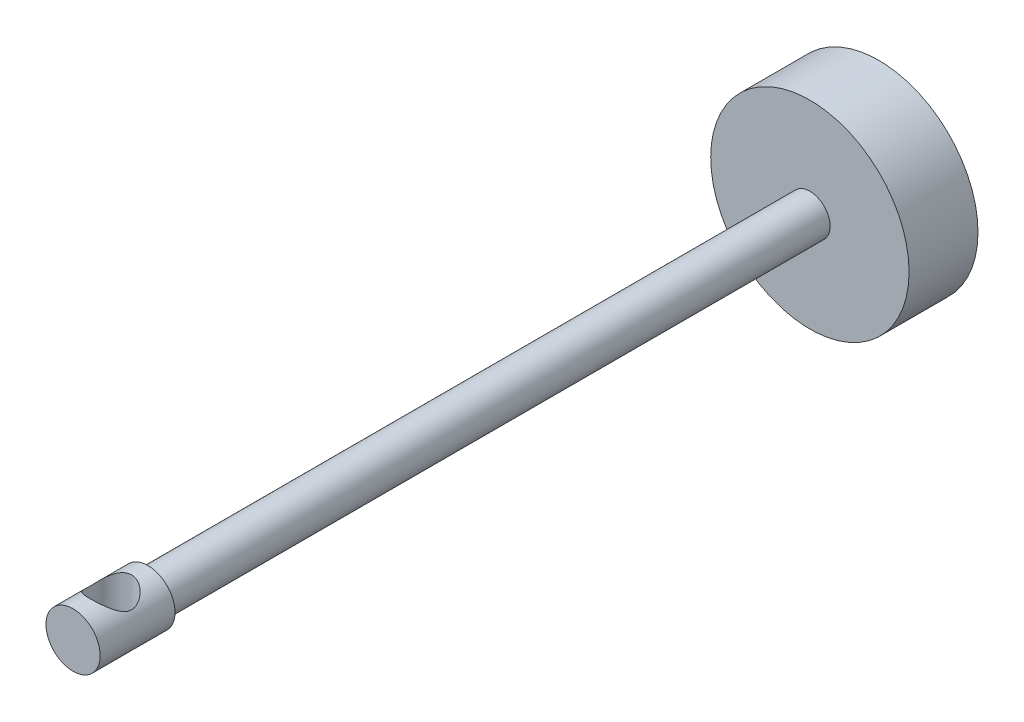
ISO-10303-21;
HEADER;
FILE_DESCRIPTION(('STEP AP214'),'2;1');
FILE_NAME('part.step','',(''),(''),'','','');
FILE_SCHEMA(('AUTOMOTIVE_DESIGN { 1 0 10303 214 1 1 1 1 }'));
ENDSEC;
DATA;
#1=APPLICATION_CONTEXT('core data for automotive mechanical design processes');
#2=APPLICATION_PROTOCOL_DEFINITION('international standard','automotive_design',2000,#1);
#3=PRODUCT_CONTEXT('',#1,'mechanical');
#4=PRODUCT('Part','Part','',(#3));
#5=PRODUCT_RELATED_PRODUCT_CATEGORY('part','',(#4));
#6=PRODUCT_DEFINITION_FORMATION('','',#4);
#7=PRODUCT_DEFINITION_CONTEXT('part definition',#1,'design');
#8=PRODUCT_DEFINITION('design','',#6,#7);
#9=PRODUCT_DEFINITION_SHAPE('','',#8);
#10=(LENGTH_UNIT() NAMED_UNIT(*) SI_UNIT(.MILLI.,.METRE.));
#11=(NAMED_UNIT(*) PLANE_ANGLE_UNIT() SI_UNIT($,.RADIAN.));
#12=(NAMED_UNIT(*) SI_UNIT($,.STERADIAN.) SOLID_ANGLE_UNIT());
#13=UNCERTAINTY_MEASURE_WITH_UNIT(LENGTH_MEASURE(1.E-05),#10,'distance_accuracy_value','');
#14=(GEOMETRIC_REPRESENTATION_CONTEXT(3) GLOBAL_UNCERTAINTY_ASSIGNED_CONTEXT((#13)) GLOBAL_UNIT_ASSIGNED_CONTEXT((#10,
#11,#12)) REPRESENTATION_CONTEXT('',''));
#15=CARTESIAN_POINT('',(0.,0.,0.));
#16=DIRECTION('',(0.,0.,1.));
#17=DIRECTION('',(1.,0.,0.));
#18=AXIS2_PLACEMENT_3D('',#15,#16,#17);
#19=CARTESIAN_POINT('',(0.,0.,93.5482));
#20=DIRECTION('',(0.,0.,-0.999999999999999));
#21=DIRECTION('',(-1.,0.,0.));
#22=AXIS2_PLACEMENT_3D('',#19,#20,#21);
#23=CYLINDRICAL_SURFACE('',#22,2.3495);
#24=CARTESIAN_POINT('',(0.,0.,8.00099999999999));
#25=DIRECTION('',(0.,0.,0.999999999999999));
#26=DIRECTION('',(1.,0.,0.));
#27=AXIS2_PLACEMENT_3D('',#24,#25,#26);
#28=CIRCLE('',#27,2.3495);
#29=CARTESIAN_POINT('',(-2.3495,0.,8.00099999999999));
#30=VERTEX_POINT('',#29);
#31=EDGE_CURVE('E97',#30,#30,#28,.F.);
#32=CARTESIAN_POINT('',(0.,0.,84.8614));
#33=DIRECTION('',(0.,0.,0.999999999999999));
#34=DIRECTION('',(1.,0.,0.));
#35=AXIS2_PLACEMENT_3D('',#32,#33,#34);
#36=CIRCLE('',#35,2.3495);
#37=CARTESIAN_POINT('',(-2.3495,0.,84.8614));
#38=VERTEX_POINT('',#37);
#39=EDGE_CURVE('E10',#38,#38,#36,.T.);
#40=CARTESIAN_POINT('',(-2.3495,0.,8.00099999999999));
#41=CARTESIAN_POINT('',(-2.3495,0.,8.80162916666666));
#42=CARTESIAN_POINT('',(-2.3495,0.,9.60225833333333));
#43=CARTESIAN_POINT('',(-2.3495,0.,11.2035166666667));
#44=CARTESIAN_POINT('',(-2.3495,0.,12.0041458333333));
#45=CARTESIAN_POINT('',(-2.3495,0.,13.6054041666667));
#46=CARTESIAN_POINT('',(-2.3495,0.,14.4060333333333));
#47=CARTESIAN_POINT('',(-2.3495,0.,16.0072916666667));
#48=CARTESIAN_POINT('',(-2.3495,0.,16.8079208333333));
#49=CARTESIAN_POINT('',(-2.3495,0.,18.4091791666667));
#50=CARTESIAN_POINT('',(-2.3495,0.,19.2098083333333));
#51=CARTESIAN_POINT('',(-2.3495,0.,20.8110666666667));
#52=CARTESIAN_POINT('',(-2.3495,0.,21.6116958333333));
#53=CARTESIAN_POINT('',(-2.3495,0.,23.2129541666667));
#54=CARTESIAN_POINT('',(-2.3495,0.,24.0135833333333));
#55=CARTESIAN_POINT('',(-2.3495,0.,25.6148416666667));
#56=CARTESIAN_POINT('',(-2.3495,0.,26.4154708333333));
#57=CARTESIAN_POINT('',(-2.3495,0.,28.0167291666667));
#58=CARTESIAN_POINT('',(-2.3495,0.,28.8173583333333));
#59=CARTESIAN_POINT('',(-2.3495,0.,30.4186166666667));
#60=CARTESIAN_POINT('',(-2.3495,0.,31.2192458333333));
#61=CARTESIAN_POINT('',(-2.3495,0.,32.8205041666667));
#62=CARTESIAN_POINT('',(-2.3495,0.,33.6211333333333));
#63=CARTESIAN_POINT('',(-2.3495,0.,35.2223916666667));
#64=CARTESIAN_POINT('',(-2.3495,0.,36.0230208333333));
#65=CARTESIAN_POINT('',(-2.3495,0.,37.6242791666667));
#66=CARTESIAN_POINT('',(-2.3495,0.,38.4249083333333));
#67=CARTESIAN_POINT('',(-2.3495,0.,40.0261666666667));
#68=CARTESIAN_POINT('',(-2.3495,0.,40.8267958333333));
#69=CARTESIAN_POINT('',(-2.3495,0.,42.4280541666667));
#70=CARTESIAN_POINT('',(-2.3495,0.,43.2286833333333));
#71=CARTESIAN_POINT('',(-2.3495,0.,44.8299416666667));
#72=CARTESIAN_POINT('',(-2.3495,0.,45.6305708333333));
#73=CARTESIAN_POINT('',(-2.3495,0.,47.2318291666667));
#74=CARTESIAN_POINT('',(-2.3495,0.,48.0324583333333));
#75=CARTESIAN_POINT('',(-2.3495,0.,49.6337166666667));
#76=CARTESIAN_POINT('',(-2.3495,0.,50.4343458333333));
#77=CARTESIAN_POINT('',(-2.3495,0.,52.0356041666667));
#78=CARTESIAN_POINT('',(-2.3495,0.,52.8362333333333));
#79=CARTESIAN_POINT('',(-2.3495,0.,54.4374916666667));
#80=CARTESIAN_POINT('',(-2.3495,0.,55.2381208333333));
#81=CARTESIAN_POINT('',(-2.3495,0.,56.8393791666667));
#82=CARTESIAN_POINT('',(-2.3495,0.,57.6400083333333));
#83=CARTESIAN_POINT('',(-2.3495,0.,59.2412666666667));
#84=CARTESIAN_POINT('',(-2.3495,0.,60.0418958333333));
#85=CARTESIAN_POINT('',(-2.3495,0.,61.6431541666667));
#86=CARTESIAN_POINT('',(-2.3495,0.,62.4437833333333));
#87=CARTESIAN_POINT('',(-2.3495,0.,64.0450416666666));
#88=CARTESIAN_POINT('',(-2.3495,0.,64.8456708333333));
#89=CARTESIAN_POINT('',(-2.3495,0.,66.4469291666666));
#90=CARTESIAN_POINT('',(-2.3495,0.,67.2475583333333));
#91=CARTESIAN_POINT('',(-2.3495,0.,68.8488166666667));
#92=CARTESIAN_POINT('',(-2.3495,0.,69.6494458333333));
#93=CARTESIAN_POINT('',(-2.3495,0.,71.2507041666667));
#94=CARTESIAN_POINT('',(-2.3495,0.,72.0513333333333));
#95=CARTESIAN_POINT('',(-2.3495,0.,73.6525916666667));
#96=CARTESIAN_POINT('',(-2.3495,0.,74.4532208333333));
#97=CARTESIAN_POINT('',(-2.3495,0.,76.0544791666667));
#98=CARTESIAN_POINT('',(-2.3495,0.,76.8551083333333));
#99=CARTESIAN_POINT('',(-2.3495,0.,78.4563666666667));
#100=CARTESIAN_POINT('',(-2.3495,0.,79.2569958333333));
#101=CARTESIAN_POINT('',(-2.3495,0.,80.8582541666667));
#102=CARTESIAN_POINT('',(-2.3495,0.,81.6588833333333));
#103=CARTESIAN_POINT('',(-2.3495,0.,83.2601416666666));
#104=CARTESIAN_POINT('',(-2.3495,0.,84.0607708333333));
#105=CARTESIAN_POINT('',(-2.3495,0.,84.8614));
#106=B_SPLINE_CURVE_WITH_KNOTS('',3,(#40,#41,#42,#43,#44,#45,#46,#47,#48,#49,#50,#51,#52,#53,
#54,#55,#56,#57,#58,#59,#60,#61,#62,#63,#64,#65,#66,#67,#68,#69,#70,#71,#72,#73,#74,#75,#76,#77,
#78,#79,#80,#81,#82,#83,#84,#85,#86,#87,#88,#89,#90,#91,#92,#93,#94,#95,#96,#97,#98,#99,#100,
#101,#102,#103,#104,#105),.UNSPECIFIED.,.F.,.F.,(4,2,2,2,2,2,2,2,2,2,2,2,2,2,2,2,2,2,2,2,2,2,2,
2,2,2,2,2,2,2,2,2,4),(0.,2.40188750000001,4.803775,7.2056625,9.60755000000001,12.0094375,
14.411325,16.8132125,19.2151,21.6169875,24.018875,26.4207625,28.82265,31.2245375,33.626425,
36.0283125,38.4302,40.8320875,43.233975,45.6358625,48.03775,50.4396375,52.841525,55.2434125,
57.6453,60.0471875,62.449075,64.8509625,67.25285,69.6547375,72.056625,74.4585125,76.8604),.UNSPECIFIED.);
#107=EDGE_CURVE('BSEAM30',#30,#38,#106,.T.);
#108=ORIENTED_EDGE('',*,*,#31,.F.);
#109=ORIENTED_EDGE('',*,*,#39,.F.);
#110=ORIENTED_EDGE('',*,*,#107,.T.);
#111=ORIENTED_EDGE('',*,*,#107,.F.);
#112=EDGE_LOOP('',(#108,#110,#109,#111));
#113=FACE_BOUND('',#112,.T.);
#114=ADVANCED_FACE('F30',(#113),#23,.T.);
#115=CARTESIAN_POINT('',(0.,0.,8.00099999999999));
#116=DIRECTION('',(0.,0.,0.999999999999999));
#117=DIRECTION('',(1.,0.,0.));
#118=AXIS2_PLACEMENT_3D('',#115,#116,#117);
#119=PLANE('',#118);
#120=CARTESIAN_POINT('',(0.,0.,8.00099999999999));
#121=DIRECTION('',(0.,0.,0.999999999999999));
#122=DIRECTION('',(1.,0.,0.));
#123=AXIS2_PLACEMENT_3D('',#120,#121,#122);
#124=CIRCLE('',#123,11.51636);
#125=CARTESIAN_POINT('',(-11.51636,0.,8.00099999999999));
#126=VERTEX_POINT('',#125);
#127=EDGE_CURVE('E42',#126,#126,#124,.T.);
#128=ORIENTED_EDGE('',*,*,#127,.T.);
#129=EDGE_LOOP('',(#128));
#130=FACE_BOUND('',#129,.T.);
#131=ORIENTED_EDGE('',*,*,#31,.T.);
#132=EDGE_LOOP('',(#131));
#133=FACE_BOUND('',#132,.T.);
#134=ADVANCED_FACE('F77',(#130,#133),#119,.T.);
#135=CARTESIAN_POINT('',(0.,0.,8.00099999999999));
#136=DIRECTION('',(0.,0.,-0.999999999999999));
#137=DIRECTION('',(-1.,0.,0.));
#138=AXIS2_PLACEMENT_3D('',#135,#136,#137);
#139=CYLINDRICAL_SURFACE('',#138,11.51636);
#140=CARTESIAN_POINT('',(0.,0.,0.));
#141=DIRECTION('',(0.,0.,0.999999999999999));
#142=DIRECTION('',(1.,0.,0.));
#143=AXIS2_PLACEMENT_3D('',#140,#141,#142);
#144=CIRCLE('',#143,11.51636);
#145=CARTESIAN_POINT('',(-11.51636,0.,0.));
#146=VERTEX_POINT('',#145);
#147=EDGE_CURVE('E47',#146,#146,#144,.T.);
#148=CARTESIAN_POINT('',(-11.51636,0.,8.00099999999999));
#149=CARTESIAN_POINT('',(-11.51636,0.,7.91765624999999));
#150=CARTESIAN_POINT('',(-11.51636,0.,7.8343125));
#151=CARTESIAN_POINT('',(-11.51636,0.,7.667625));
#152=CARTESIAN_POINT('',(-11.51636,0.,7.58428125));
#153=CARTESIAN_POINT('',(-11.51636,0.,7.41759375));
#154=CARTESIAN_POINT('',(-11.51636,0.,7.33425));
#155=CARTESIAN_POINT('',(-11.51636,0.,7.1675625));
#156=CARTESIAN_POINT('',(-11.51636,0.,7.08421875));
#157=CARTESIAN_POINT('',(-11.51636,0.,6.91753125));
#158=CARTESIAN_POINT('',(-11.51636,0.,6.8341875));
#159=CARTESIAN_POINT('',(-11.51636,0.,6.6675));
#160=CARTESIAN_POINT('',(-11.51636,0.,6.58415625));
#161=CARTESIAN_POINT('',(-11.51636,0.,6.41746875));
#162=CARTESIAN_POINT('',(-11.51636,0.,6.334125));
#163=CARTESIAN_POINT('',(-11.51636,0.,6.1674375));
#164=CARTESIAN_POINT('',(-11.51636,0.,6.08409375));
#165=CARTESIAN_POINT('',(-11.51636,0.,5.91740625));
#166=CARTESIAN_POINT('',(-11.51636,0.,5.8340625));
#167=CARTESIAN_POINT('',(-11.51636,0.,5.667375));
#168=CARTESIAN_POINT('',(-11.51636,0.,5.58403125));
#169=CARTESIAN_POINT('',(-11.51636,0.,5.41734375));
#170=CARTESIAN_POINT('',(-11.51636,0.,5.334));
#171=CARTESIAN_POINT('',(-11.51636,0.,5.1673125));
#172=CARTESIAN_POINT('',(-11.51636,0.,5.08396875));
#173=CARTESIAN_POINT('',(-11.51636,0.,4.91728125));
#174=CARTESIAN_POINT('',(-11.51636,0.,4.8339375));
#175=CARTESIAN_POINT('',(-11.51636,0.,4.66725));
#176=CARTESIAN_POINT('',(-11.51636,0.,4.58390625));
#177=CARTESIAN_POINT('',(-11.51636,0.,4.41721875));
#178=CARTESIAN_POINT('',(-11.51636,0.,4.333875));
#179=CARTESIAN_POINT('',(-11.51636,0.,4.1671875));
#180=CARTESIAN_POINT('',(-11.51636,0.,4.08384375));
#181=CARTESIAN_POINT('',(-11.51636,0.,3.91715625));
#182=CARTESIAN_POINT('',(-11.51636,0.,3.8338125));
#183=CARTESIAN_POINT('',(-11.51636,0.,3.667125));
#184=CARTESIAN_POINT('',(-11.51636,0.,3.58378125));
#185=CARTESIAN_POINT('',(-11.51636,0.,3.41709375));
#186=CARTESIAN_POINT('',(-11.51636,0.,3.33375));
#187=CARTESIAN_POINT('',(-11.51636,0.,3.1670625));
#188=CARTESIAN_POINT('',(-11.51636,0.,3.08371875));
#189=CARTESIAN_POINT('',(-11.51636,0.,2.91703125));
#190=CARTESIAN_POINT('',(-11.51636,0.,2.8336875));
#191=CARTESIAN_POINT('',(-11.51636,0.,2.667));
#192=CARTESIAN_POINT('',(-11.51636,0.,2.58365625));
#193=CARTESIAN_POINT('',(-11.51636,0.,2.41696875));
#194=CARTESIAN_POINT('',(-11.51636,0.,2.333625));
#195=CARTESIAN_POINT('',(-11.51636,0.,2.1669375));
#196=CARTESIAN_POINT('',(-11.51636,0.,2.08359375));
#197=CARTESIAN_POINT('',(-11.51636,0.,1.91690625));
#198=CARTESIAN_POINT('',(-11.51636,0.,1.8335625));
#199=CARTESIAN_POINT('',(-11.51636,0.,1.666875));
#200=CARTESIAN_POINT('',(-11.51636,0.,1.58353125));
#201=CARTESIAN_POINT('',(-11.51636,0.,1.41684375));
#202=CARTESIAN_POINT('',(-11.51636,0.,1.3335));
#203=CARTESIAN_POINT('',(-11.51636,0.,1.1668125));
#204=CARTESIAN_POINT('',(-11.51636,0.,1.08346875));
#205=CARTESIAN_POINT('',(-11.51636,0.,0.916781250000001));
#206=CARTESIAN_POINT('',(-11.51636,0.,0.833437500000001));
#207=CARTESIAN_POINT('',(-11.51636,0.,0.666750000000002));
#208=CARTESIAN_POINT('',(-11.51636,0.,0.583406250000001));
#209=CARTESIAN_POINT('',(-11.51636,0.,0.416718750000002));
#210=CARTESIAN_POINT('',(-11.51636,0.,0.333375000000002));
#211=CARTESIAN_POINT('',(-11.51636,0.,0.166687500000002));
#212=CARTESIAN_POINT('',(-11.51636,0.,0.0833437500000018));
#213=CARTESIAN_POINT('',(-11.51636,0.,0.));
#214=B_SPLINE_CURVE_WITH_KNOTS('',3,(#148,#149,#150,#151,#152,#153,#154,#155,#156,#157,#158,
#159,#160,#161,#162,#163,#164,#165,#166,#167,#168,#169,#170,#171,#172,#173,#174,#175,#176,#177,
#178,#179,#180,#181,#182,#183,#184,#185,#186,#187,#188,#189,#190,#191,#192,#193,#194,#195,#196,
#197,#198,#199,#200,#201,#202,#203,#204,#205,#206,#207,#208,#209,#210,#211,#212,#213),
.UNSPECIFIED.,.F.,.F.,(4,2,2,2,2,2,2,2,2,2,2,2,2,2,2,2,2,2,2,2,2,2,2,2,2,2,2,2,2,2,2,2,4),(0.,
0.250031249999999,0.500062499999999,0.750093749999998,1.000125,1.25015625,1.5001875,1.75021875,
2.00025,2.25028125,2.5003125,2.75034375,3.000375,3.25040625,3.5004375,3.75046875,4.0005,
4.25053125,4.50056249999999,4.75059374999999,5.00062499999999,5.25065625,5.50068749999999,
5.75071874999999,6.00074999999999,6.25078124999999,6.50081249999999,6.75084374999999,
7.00087499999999,7.25090624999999,7.50093749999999,7.75096874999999,8.00099999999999),.UNSPECIFIED.);
#215=EDGE_CURVE('BSEAM32',#126,#146,#214,.T.);
#216=ORIENTED_EDGE('',*,*,#127,.F.);
#217=ORIENTED_EDGE('',*,*,#147,.T.);
#218=ORIENTED_EDGE('',*,*,#215,.T.);
#219=ORIENTED_EDGE('',*,*,#215,.F.);
#220=EDGE_LOOP('',(#216,#218,#217,#219));
#221=FACE_BOUND('',#220,.T.);
#222=ADVANCED_FACE('F32',(#221),#139,.T.);
#223=CARTESIAN_POINT('',(0.,0.,0.));
#224=DIRECTION('',(0.,0.,0.999999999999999));
#225=DIRECTION('',(1.,0.,0.));
#226=AXIS2_PLACEMENT_3D('',#223,#224,#225);
#227=PLANE('',#226);
#228=ORIENTED_EDGE('',*,*,#147,.F.);
#229=EDGE_LOOP('',(#228));
#230=FACE_BOUND('',#229,.T.);
#231=ADVANCED_FACE('F66',(#230),#227,.F.);
#232=CARTESIAN_POINT('',(0.,0.,84.8614));
#233=DIRECTION('',(0.,0.,0.999999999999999));
#234=DIRECTION('',(1.,0.,0.));
#235=AXIS2_PLACEMENT_3D('',#232,#233,#234);
#236=PLANE('',#235);
#237=CARTESIAN_POINT('',(0.,0.,84.8614));
#238=DIRECTION('',(0.,0.,0.999999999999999));
#239=DIRECTION('',(1.,0.,0.));
#240=AXIS2_PLACEMENT_3D('',#237,#238,#239);
#241=CIRCLE('',#240,3.1496);
#242=CARTESIAN_POINT('',(3.14960000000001,0.,84.8614));
#243=VERTEX_POINT('',#242);
#244=EDGE_CURVE('E94',#243,#243,#241,.T.);
#245=ORIENTED_EDGE('',*,*,#244,.F.);
#246=EDGE_LOOP('',(#245));
#247=FACE_BOUND('',#246,.T.);
#248=ORIENTED_EDGE('',*,*,#39,.T.);
#249=EDGE_LOOP('',(#248));
#250=FACE_BOUND('',#249,.T.);
#251=ADVANCED_FACE('F63',(#247,#250),#236,.F.);
#252=CARTESIAN_POINT('',(0.,0.,84.8614));
#253=DIRECTION('',(0.,0.,0.999999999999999));
#254=DIRECTION('',(1.,0.,0.));
#255=AXIS2_PLACEMENT_3D('',#252,#253,#254);
#256=CYLINDRICAL_SURFACE('',#255,3.1496);
#257=CARTESIAN_POINT('',(0.,-3.14959999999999,91.5542999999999));
#258=CARTESIAN_POINT('',(-0.116753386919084,-3.14959081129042,91.554290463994));
#259=CARTESIAN_POINT('',(-0.233649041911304,-3.14304210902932,91.5457147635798));
#260=CARTESIAN_POINT('',(-0.463709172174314,-3.11743809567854,91.5119643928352));
#261=CARTESIAN_POINT('',(-0.576865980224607,-3.09835857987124,91.4867575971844));
#262=CARTESIAN_POINT('',(-0.795546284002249,-3.04951955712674,91.421486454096));
#263=CARTESIAN_POINT('',(-0.901110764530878,-3.01982353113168,91.381510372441));
#264=CARTESIAN_POINT('',(-1.10331111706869,-2.95196125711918,91.288605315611));
#265=CARTESIAN_POINT('',(-1.19994820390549,-2.91379616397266,91.235678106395));
#266=CARTESIAN_POINT('',(-1.39183412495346,-2.82751662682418,91.1131793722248));
#267=CARTESIAN_POINT('',(-1.48611192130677,-2.77880608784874,91.0425155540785));
#268=CARTESIAN_POINT('',(-1.66224686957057,-2.67717756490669,90.8895149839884));
#269=CARTESIAN_POINT('',(-1.74408527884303,-2.62425341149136,90.8071609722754));
#270=CARTESIAN_POINT('',(-1.91071251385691,-2.50631564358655,90.6135250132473));
#271=CARTESIAN_POINT('',(-1.99252333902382,-2.44109349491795,90.4997979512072));
#272=CARTESIAN_POINT('',(-2.13623724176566,-2.31634876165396,90.2575073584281));
#273=CARTESIAN_POINT('',(-2.19816512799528,-2.25681913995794,90.1289625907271));
#274=CARTESIAN_POINT('',(-2.28171742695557,-2.17163210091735,89.9050222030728));
#275=CARTESIAN_POINT('',(-2.30985946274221,-2.14141794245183,89.8138157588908));
#276=CARTESIAN_POINT('',(-2.35538232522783,-2.09124548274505,89.626120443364));
#277=CARTESIAN_POINT('',(-2.37278826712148,-2.07126326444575,89.5296444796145));
#278=CARTESIAN_POINT('',(-2.39573683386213,-2.04469222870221,89.3323673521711));
#279=CARTESIAN_POINT('',(-2.40115952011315,-2.0382388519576,89.2315326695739));
#280=CARTESIAN_POINT('',(-2.39921698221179,-2.04052395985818,89.0301445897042));
#281=CARTESIAN_POINT('',(-2.39184927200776,-2.04926539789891,88.9295912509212));
#282=CARTESIAN_POINT('',(-2.36666505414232,-2.07826123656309,88.7440345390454));
#283=CARTESIAN_POINT('',(-2.35018575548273,-2.09703353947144,88.6585974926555));
#284=CARTESIAN_POINT('',(-2.30880032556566,-2.14251470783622,88.4919876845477));
#285=CARTESIAN_POINT('',(-2.28388546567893,-2.16923179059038,88.4108194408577));
#286=CARTESIAN_POINT('',(-2.20797394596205,-2.24707717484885,88.2025115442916));
#287=CARTESIAN_POINT('',(-2.15051705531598,-2.30284017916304,88.0794623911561));
#288=CARTESIAN_POINT('',(-2.01746799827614,-2.42027547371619,87.8465927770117));
#289=CARTESIAN_POINT('',(-1.9418303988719,-2.48196233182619,87.7368065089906));
#290=CARTESIAN_POINT('',(-1.77089813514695,-2.60680744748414,87.5279351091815));
#291=CARTESIAN_POINT('',(-1.67508616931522,-2.6699549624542,87.4292648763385));
#292=CARTESIAN_POINT('',(-1.46595637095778,-2.79024398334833,87.2483615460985));
#293=CARTESIAN_POINT('',(-1.35267127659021,-2.84739639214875,87.1660983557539));
#294=CARTESIAN_POINT('',(-1.13278231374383,-2.94078675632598,87.0347121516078));
#295=CARTESIAN_POINT('',(-1.02898728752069,-2.97893550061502,86.9822627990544));
#296=CARTESIAN_POINT('',(-0.81210486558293,-3.04520762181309,86.892212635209));
#297=CARTESIAN_POINT('',(-0.69902298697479,-3.07333689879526,86.8546030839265));
#298=CARTESIAN_POINT('',(-0.46539167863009,-3.11730600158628,86.7961553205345));
#299=CARTESIAN_POINT('',(-0.344797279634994,-3.13306219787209,86.775431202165));
#300=CARTESIAN_POINT('',(-0.100858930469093,-3.15035337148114,86.752699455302));
#301=CARTESIAN_POINT('',(0.022483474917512,-3.15189614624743,86.7506815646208));
#302=CARTESIAN_POINT('',(0.253781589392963,-3.14125667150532,86.7646559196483));
#303=CARTESIAN_POINT('',(0.361934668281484,-3.13056860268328,86.7786874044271));
#304=CARTESIAN_POINT('',(0.573852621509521,-3.09873495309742,86.8208030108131));
#305=CARTESIAN_POINT('',(0.677616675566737,-3.07758742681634,86.8488897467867));
#306=CARTESIAN_POINT('',(0.880898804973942,-3.0257687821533,86.9185379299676));
#307=CARTESIAN_POINT('',(0.980253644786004,-2.99487983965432,86.9604086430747));
#308=CARTESIAN_POINT('',(1.17044099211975,-2.92579860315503,87.0557068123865));
#309=CARTESIAN_POINT('',(1.26127218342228,-2.88760518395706,87.1091360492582));
#310=CARTESIAN_POINT('',(1.44771669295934,-2.79935733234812,87.2356036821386));
#311=CARTESIAN_POINT('',(1.54168278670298,-2.74838464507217,87.3104199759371));
#312=CARTESIAN_POINT('',(1.71658309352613,-2.64268427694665,87.4720355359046));
#313=CARTESIAN_POINT('',(1.79749107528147,-2.58794934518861,87.5588582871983));
#314=CARTESIAN_POINT('',(1.91606853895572,-2.50034531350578,87.7065314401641));
#315=CARTESIAN_POINT('',(1.95810722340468,-2.46746798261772,87.7639178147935));
#316=CARTESIAN_POINT('',(2.03714211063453,-2.40263503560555,87.8825519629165));
#317=CARTESIAN_POINT('',(2.07413652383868,-2.37067974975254,87.9438010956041));
#318=CARTESIAN_POINT('',(2.17711958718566,-2.27784489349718,88.1331234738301));
#319=CARTESIAN_POINT('',(2.23539805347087,-2.21977096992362,88.2671298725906));
#320=CARTESIAN_POINT('',(2.3100641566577,-2.1413404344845,88.4956266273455));
#321=CARTESIAN_POINT('',(2.33394940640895,-2.11505134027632,88.5856464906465));
#322=CARTESIAN_POINT('',(2.37126859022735,-2.07312776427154,88.7701538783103));
#323=CARTESIAN_POINT('',(2.38472767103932,-2.05746765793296,88.8646300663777));
#324=CARTESIAN_POINT('',(2.40026378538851,-2.03933325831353,89.0565659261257));
#325=CARTESIAN_POINT('',(2.40225441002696,-2.03695907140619,89.1540426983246));
#326=CARTESIAN_POINT('',(2.39442674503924,-2.0461488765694,89.3478910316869));
#327=CARTESIAN_POINT('',(2.38459766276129,-2.05772560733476,89.444261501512));
#328=CARTESIAN_POINT('',(2.35168396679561,-2.09529291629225,89.64706892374));
#329=CARTESIAN_POINT('',(2.32683408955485,-2.12318306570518,89.7528510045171));
#330=CARTESIAN_POINT('',(2.26447746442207,-2.18956301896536,89.9571542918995));
#331=CARTESIAN_POINT('',(2.22693769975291,-2.22808042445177,90.0556557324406));
#332=CARTESIAN_POINT('',(2.12343336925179,-2.32765655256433,90.2825566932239));
#333=CARTESIAN_POINT('',(2.05210269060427,-2.39158259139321,90.4072358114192));
#334=CARTESIAN_POINT('',(1.88942507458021,-2.52210030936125,90.6412238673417));
#335=CARTESIAN_POINT('',(1.79805433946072,-2.58869508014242,90.7505142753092));
#336=CARTESIAN_POINT('',(1.5943732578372,-2.71897484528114,90.9541311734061));
#337=CARTESIAN_POINT('',(1.48174765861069,-2.78259522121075,91.0481865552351));
#338=CARTESIAN_POINT('',(1.23757845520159,-2.89941028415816,91.2159512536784));
#339=CARTESIAN_POINT('',(1.10607875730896,-2.95262850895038,91.2897066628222));
#340=CARTESIAN_POINT('',(0.86566367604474,-3.03016134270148,91.3954798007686));
#341=CARTESIAN_POINT('',(0.760594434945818,-3.0583987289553,91.4333998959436));
#342=CARTESIAN_POINT('',(0.544143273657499,-3.10419654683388,91.4944940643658));
#343=CARTESIAN_POINT('',(0.432777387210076,-3.12178287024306,91.5177039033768));
#344=CARTESIAN_POINT('',(0.267011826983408,-3.13871392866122,91.5400011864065));
#345=CARTESIAN_POINT('',(0.213847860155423,-3.14278566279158,91.5453525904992));
#346=CARTESIAN_POINT('',(0.107132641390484,-3.14823111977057,91.5525045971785));
#347=CARTESIAN_POINT('',(0.0535813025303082,-3.14960421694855,91.5543043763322));
#348=CARTESIAN_POINT('',(0.,-3.14959999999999,91.5542999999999));
#349=B_SPLINE_CURVE_WITH_KNOTS('',3,(#257,#258,#259,#260,#261,#262,#263,#264,#265,#266,#267,
#268,#269,#270,#271,#272,#273,#274,#275,#276,#277,#278,#279,#280,#281,#282,#283,#284,#285,#286,
#287,#288,#289,#290,#291,#292,#293,#294,#295,#296,#297,#298,#299,#300,#301,#302,#303,#304,#305,
#306,#307,#308,#309,#310,#311,#312,#313,#314,#315,#316,#317,#318,#319,#320,#321,#322,#323,#324,
#325,#326,#327,#328,#329,#330,#331,#332,#333,#334,#335,#336,#337,#338,#339,#340,#341,#342,#343,
#344,#345,#346,#347,#348),.UNSPECIFIED.,.T.,.F.,(4,2,2,2,2,2,2,2,2,2,2,2,2,2,2,2,2,2,2,2,2,2,2,
2,2,2,2,2,2,2,2,2,2,2,2,2,2,2,2,2,2,2,2,2,2,4),(0.,0.350030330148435,0.70073878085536,
1.0493843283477,1.39798236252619,1.77910995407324,2.16080622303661,2.62251905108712,
3.08365352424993,3.38302933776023,3.68170213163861,3.98335100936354,4.2850585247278,
4.55112339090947,4.81746441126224,5.2554776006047,5.69459696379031,6.14676413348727,
6.59809417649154,6.96381209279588,7.32931429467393,7.69726615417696,8.06501614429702,
8.39222858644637,8.7195019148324,9.05468517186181,9.38992010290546,9.77997912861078,
10.1708122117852,10.4056602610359,10.6405914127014,11.1089314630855,11.3982846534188,
11.6869377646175,11.9777629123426,12.2688538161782,12.6035543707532,12.9391325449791,
13.4083870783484,13.8782019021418,14.3556279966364,14.8319609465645,15.1762345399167,
15.51966784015,15.6802690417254,15.8409074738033),.UNSPECIFIED.);
#350=CARTESIAN_POINT('',(0.,-3.14959999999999,91.5542999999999));
#351=VERTEX_POINT('',#350);
#352=EDGE_CURVE('E34',#351,#351,#349,.T.);
#353=ORIENTED_EDGE('',*,*,#352,.F.);
#354=EDGE_LOOP('',(#353));
#355=FACE_BOUND('',#354,.T.);
#356=CARTESIAN_POINT('',(0.,3.1496,91.5543));
#357=CARTESIAN_POINT('',(0.116753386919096,3.14959081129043,91.5542904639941));
#358=CARTESIAN_POINT('',(0.233649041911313,3.14304210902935,91.5457147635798));
#359=CARTESIAN_POINT('',(0.463709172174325,3.11743809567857,91.5119643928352));
#360=CARTESIAN_POINT('',(0.576865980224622,3.09835857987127,91.4867575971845));
#361=CARTESIAN_POINT('',(0.795546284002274,3.04951955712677,91.4214864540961));
#362=CARTESIAN_POINT('',(0.901110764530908,3.01982353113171,91.3815103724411));
#363=CARTESIAN_POINT('',(1.10331111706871,2.95196125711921,91.288605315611));
#364=CARTESIAN_POINT('',(1.1999482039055,2.91379616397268,91.2356781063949));
#365=CARTESIAN_POINT('',(1.39183412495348,2.82751662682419,91.1131793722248));
#366=CARTESIAN_POINT('',(1.48611192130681,2.77880608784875,91.0425155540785));
#367=CARTESIAN_POINT('',(1.66224686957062,2.67717756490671,90.8895149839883));
#368=CARTESIAN_POINT('',(1.74408527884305,2.62425341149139,90.8071609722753));
#369=CARTESIAN_POINT('',(1.91071251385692,2.50631564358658,90.6135250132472));
#370=CARTESIAN_POINT('',(1.99252333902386,2.44109349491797,90.4997979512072));
#371=CARTESIAN_POINT('',(2.13623724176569,2.31634876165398,90.257507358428));
#372=CARTESIAN_POINT('',(2.19816512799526,2.25681913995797,90.128962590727));
#373=CARTESIAN_POINT('',(2.28171742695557,2.17163210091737,89.9050222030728));
#374=CARTESIAN_POINT('',(2.30985946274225,2.14141794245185,89.8138157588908));
#375=CARTESIAN_POINT('',(2.35538232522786,2.09124548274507,89.626120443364));
#376=CARTESIAN_POINT('',(2.37278826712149,2.07126326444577,89.5296444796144));
#377=CARTESIAN_POINT('',(2.39573683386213,2.04469222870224,89.332367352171));
#378=CARTESIAN_POINT('',(2.40115952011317,2.03823885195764,89.2315326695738));
#379=CARTESIAN_POINT('',(2.39921698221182,2.04052395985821,89.0301445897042));
#380=CARTESIAN_POINT('',(2.39184927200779,2.04926539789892,88.9295912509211));
#381=CARTESIAN_POINT('',(2.36666505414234,2.07826123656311,88.7440345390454));
#382=CARTESIAN_POINT('',(2.35018575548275,2.09703353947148,88.6585974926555));
#383=CARTESIAN_POINT('',(2.30880032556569,2.14251470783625,88.4919876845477));
#384=CARTESIAN_POINT('',(2.28388546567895,2.16923179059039,88.4108194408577));
#385=CARTESIAN_POINT('',(2.20797394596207,2.24707717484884,88.2025115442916));
#386=CARTESIAN_POINT('',(2.150517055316,2.30284017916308,88.0794623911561));
#387=CARTESIAN_POINT('',(2.01746799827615,2.42027547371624,87.8465927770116));
#388=CARTESIAN_POINT('',(1.94183039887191,2.48196233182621,87.7368065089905));
#389=CARTESIAN_POINT('',(1.77089813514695,2.60680744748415,87.5279351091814));
#390=CARTESIAN_POINT('',(1.67508616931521,2.66995496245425,87.4292648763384));
#391=CARTESIAN_POINT('',(1.46595637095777,2.79024398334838,87.2483615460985));
#392=CARTESIAN_POINT('',(1.3526712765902,2.84739639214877,87.1660983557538));
#393=CARTESIAN_POINT('',(1.13278231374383,2.940786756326,87.0347121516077));
#394=CARTESIAN_POINT('',(1.02898728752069,2.97893550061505,86.9822627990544));
#395=CARTESIAN_POINT('',(0.812104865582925,3.04520762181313,86.892212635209));
#396=CARTESIAN_POINT('',(0.699022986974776,3.07333689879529,86.8546030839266));
#397=CARTESIAN_POINT('',(0.465391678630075,3.1173060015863,86.7961553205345));
#398=CARTESIAN_POINT('',(0.344797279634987,3.13306219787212,86.775431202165));
#399=CARTESIAN_POINT('',(0.100858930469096,3.15035337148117,86.752699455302));
#400=CARTESIAN_POINT('',(-0.0224834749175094,3.15189614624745,86.7506815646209));
#401=CARTESIAN_POINT('',(-0.253781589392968,3.14125667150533,86.7646559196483));
#402=CARTESIAN_POINT('',(-0.361934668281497,3.13056860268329,86.7786874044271));
#403=CARTESIAN_POINT('',(-0.573852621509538,3.09873495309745,86.8208030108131));
#404=CARTESIAN_POINT('',(-0.677616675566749,3.07758742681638,86.8488897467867));
#405=CARTESIAN_POINT('',(-0.880898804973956,3.02576878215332,86.9185379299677));
#406=CARTESIAN_POINT('',(-0.980253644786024,2.99487983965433,86.9604086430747));
#407=CARTESIAN_POINT('',(-1.17044099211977,2.92579860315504,87.0557068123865));
#408=CARTESIAN_POINT('',(-1.2612721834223,2.88760518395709,87.1091360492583));
#409=CARTESIAN_POINT('',(-1.44771669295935,2.79935733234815,87.2356036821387));
#410=CARTESIAN_POINT('',(-1.54168278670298,2.74838464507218,87.3104199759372));
#411=CARTESIAN_POINT('',(-1.71658309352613,2.64268427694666,87.4720355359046));
#412=CARTESIAN_POINT('',(-1.79749107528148,2.58794934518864,87.5588582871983));
#413=CARTESIAN_POINT('',(-1.91606853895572,2.50034531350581,87.7065314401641));
#414=CARTESIAN_POINT('',(-1.95810722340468,2.46746798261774,87.7639178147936));
#415=CARTESIAN_POINT('',(-2.03714211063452,2.40263503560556,87.8825519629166));
#416=CARTESIAN_POINT('',(-2.07413652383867,2.37067974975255,87.9438010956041));
#417=CARTESIAN_POINT('',(-2.17711958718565,2.2778448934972,88.1331234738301));
#418=CARTESIAN_POINT('',(-2.23539805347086,2.21977096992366,88.2671298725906));
#419=CARTESIAN_POINT('',(-2.31006415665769,2.14134043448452,88.4956266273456));
#420=CARTESIAN_POINT('',(-2.33394940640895,2.11505134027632,88.5856464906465));
#421=CARTESIAN_POINT('',(-2.37126859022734,2.07312776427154,88.7701538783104));
#422=CARTESIAN_POINT('',(-2.38472767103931,2.05746765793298,88.8646300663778));
#423=CARTESIAN_POINT('',(-2.40026378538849,2.03933325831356,89.0565659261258));
#424=CARTESIAN_POINT('',(-2.40225441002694,2.03695907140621,89.1540426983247));
#425=CARTESIAN_POINT('',(-2.39442674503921,2.04614887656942,89.347891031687));
#426=CARTESIAN_POINT('',(-2.38459766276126,2.05772560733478,89.4442615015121));
#427=CARTESIAN_POINT('',(-2.35168396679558,2.09529291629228,89.6470689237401));
#428=CARTESIAN_POINT('',(-2.32683408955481,2.12318306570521,89.7528510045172));
#429=CARTESIAN_POINT('',(-2.26447746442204,2.18956301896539,89.9571542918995));
#430=CARTESIAN_POINT('',(-2.2269376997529,2.2280804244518,90.0556557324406));
#431=CARTESIAN_POINT('',(-2.12343336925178,2.32765655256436,90.282556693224));
#432=CARTESIAN_POINT('',(-2.05210269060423,2.39158259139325,90.4072358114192));
#433=CARTESIAN_POINT('',(-1.88942507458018,2.52210030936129,90.6412238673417));
#434=CARTESIAN_POINT('',(-1.79805433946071,2.58869508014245,90.7505142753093));
#435=CARTESIAN_POINT('',(-1.5943732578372,2.71897484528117,90.9541311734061));
#436=CARTESIAN_POINT('',(-1.48174765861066,2.78259522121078,91.0481865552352));
#437=CARTESIAN_POINT('',(-1.23757845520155,2.8994102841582,91.2159512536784));
#438=CARTESIAN_POINT('',(-1.10607875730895,2.95262850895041,91.2897066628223));
#439=CARTESIAN_POINT('',(-0.865663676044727,3.03016134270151,91.3954798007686));
#440=CARTESIAN_POINT('',(-0.760594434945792,3.05839872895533,91.4333998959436));
#441=CARTESIAN_POINT('',(-0.544143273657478,3.10419654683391,91.4944940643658));
#442=CARTESIAN_POINT('',(-0.432777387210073,3.12178287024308,91.5177039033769));
#443=CARTESIAN_POINT('',(-0.267011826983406,3.13871392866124,91.5400011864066));
#444=CARTESIAN_POINT('',(-0.213847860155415,3.14278566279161,91.5453525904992));
#445=CARTESIAN_POINT('',(-0.10713264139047,3.1482311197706,91.5525045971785));
#446=CARTESIAN_POINT('',(-0.0535813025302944,3.14960421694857,91.5543043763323));
#447=CARTESIAN_POINT('',(0.,3.1496,91.5543));
#448=B_SPLINE_CURVE_WITH_KNOTS('',3,(#356,#357,#358,#359,#360,#361,#362,#363,#364,#365,#366,
#367,#368,#369,#370,#371,#372,#373,#374,#375,#376,#377,#378,#379,#380,#381,#382,#383,#384,#385,
#386,#387,#388,#389,#390,#391,#392,#393,#394,#395,#396,#397,#398,#399,#400,#401,#402,#403,#404,
#405,#406,#407,#408,#409,#410,#411,#412,#413,#414,#415,#416,#417,#418,#419,#420,#421,#422,#423,
#424,#425,#426,#427,#428,#429,#430,#431,#432,#433,#434,#435,#436,#437,#438,#439,#440,#441,#442,
#443,#444,#445,#446,#447),.UNSPECIFIED.,.T.,.F.,(4,2,2,2,2,2,2,2,2,2,2,2,2,2,2,2,2,2,2,2,2,2,2,
2,2,2,2,2,2,2,2,2,2,2,2,2,2,2,2,2,2,2,2,2,2,4),(0.,0.350030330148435,0.70073878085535,
1.04938432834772,1.39798236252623,1.77910995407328,2.16080622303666,2.62251905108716,
3.08365352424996,3.3830293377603,3.68170213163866,3.98335100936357,4.28505852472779,
4.55112339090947,4.81746441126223,5.25547760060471,5.69459696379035,6.14676413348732,
6.59809417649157,6.9638120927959,7.32931429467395,7.69726615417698,8.06501614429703,
8.39222858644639,8.71950191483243,9.05468517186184,9.38992010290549,9.77997912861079,
10.1708122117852,10.4056602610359,10.6405914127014,11.1089314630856,11.3982846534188,
11.6869377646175,11.9777629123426,12.2688538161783,12.6035543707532,12.9391325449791,
13.4083870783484,13.8782019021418,14.3556279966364,14.8319609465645,15.1762345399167,
15.51966784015,15.6802690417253,15.8409074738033),.UNSPECIFIED.);
#449=CARTESIAN_POINT('',(0.,3.1496,91.5543));
#450=VERTEX_POINT('',#449);
#451=EDGE_CURVE('E50',#450,#450,#448,.T.);
#452=ORIENTED_EDGE('',*,*,#451,.F.);
#453=EDGE_LOOP('',(#452));
#454=FACE_BOUND('',#453,.T.);
#455=ORIENTED_EDGE('',*,*,#244,.T.);
#456=EDGE_LOOP('',(#455));
#457=FACE_BOUND('',#456,.T.);
#458=CARTESIAN_POINT('',(0.,0.,93.5482));
#459=DIRECTION('',(0.,0.,0.999999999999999));
#460=DIRECTION('',(1.,0.,0.));
#461=AXIS2_PLACEMENT_3D('',#458,#459,#460);
#462=CIRCLE('',#461,3.1496);
#463=CARTESIAN_POINT('',(3.1496,0.,93.5482));
#464=VERTEX_POINT('',#463);
#465=EDGE_CURVE('E92',#464,#464,#462,.T.);
#466=ORIENTED_EDGE('',*,*,#465,.F.);
#467=EDGE_LOOP('',(#466));
#468=FACE_BOUND('',#467,.T.);
#469=ADVANCED_FACE('F54',(#355,#454,#457,#468),#256,.T.);
#470=CARTESIAN_POINT('',(0.,0.,93.5482));
#471=DIRECTION('',(0.,0.,0.999999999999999));
#472=DIRECTION('',(1.,0.,0.));
#473=AXIS2_PLACEMENT_3D('',#470,#471,#472);
#474=PLANE('',#473);
#475=ORIENTED_EDGE('',*,*,#465,.T.);
#476=EDGE_LOOP('',(#475));
#477=FACE_BOUND('',#476,.T.);
#478=ADVANCED_FACE('F61',(#477),#474,.T.);
#479=CARTESIAN_POINT('',(0.,-11.51636,89.154));
#480=DIRECTION('',(0.,1.,0.));
#481=DIRECTION('',(0.,0.,0.999999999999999));
#482=AXIS2_PLACEMENT_3D('',#479,#480,#481);
#483=CYLINDRICAL_SURFACE('',#482,2.4003);
#484=ORIENTED_EDGE('',*,*,#352,.T.);
#485=EDGE_LOOP('',(#484));
#486=FACE_BOUND('',#485,.T.);
#487=ORIENTED_EDGE('',*,*,#451,.T.);
#488=EDGE_LOOP('',(#487));
#489=FACE_BOUND('',#488,.T.);
#490=ADVANCED_FACE('F58',(#486,#489),#483,.F.);
#491=CLOSED_SHELL('',(#114,#134,#222,#231,#251,#469,#478,#490));
#492=MANIFOLD_SOLID_BREP('B2',#491);
#493=ADVANCED_BREP_SHAPE_REPRESENTATION('',(#18,#492),#14);
#494=SHAPE_DEFINITION_REPRESENTATION(#9,#493);
ENDSEC;
END-ISO-10303-21;
